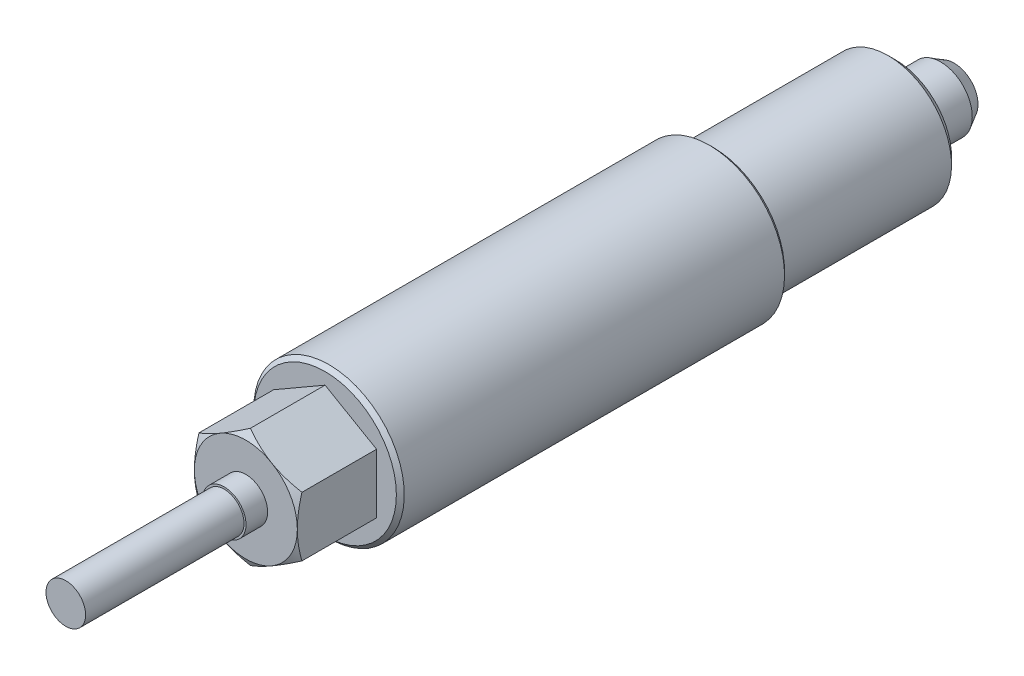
ISO-10303-21;
HEADER;
FILE_DESCRIPTION(('STEP AP214'),'2;1');
FILE_NAME('part.step','',(''),(''),'','','');
FILE_SCHEMA(('AUTOMOTIVE_DESIGN { 1 0 10303 214 1 1 1 1 }'));
ENDSEC;
DATA;
#1=APPLICATION_CONTEXT('core data for automotive mechanical design processes');
#2=APPLICATION_PROTOCOL_DEFINITION('international standard','automotive_design',2000,#1);
#3=PRODUCT_CONTEXT('',#1,'mechanical');
#4=PRODUCT('Part','Part','',(#3));
#5=PRODUCT_RELATED_PRODUCT_CATEGORY('part','',(#4));
#6=PRODUCT_DEFINITION_FORMATION('','',#4);
#7=PRODUCT_DEFINITION_CONTEXT('part definition',#1,'design');
#8=PRODUCT_DEFINITION('design','',#6,#7);
#9=PRODUCT_DEFINITION_SHAPE('','',#8);
#10=(LENGTH_UNIT() NAMED_UNIT(*) SI_UNIT(.MILLI.,.METRE.));
#11=(NAMED_UNIT(*) PLANE_ANGLE_UNIT() SI_UNIT($,.RADIAN.));
#12=(NAMED_UNIT(*) SI_UNIT($,.STERADIAN.) SOLID_ANGLE_UNIT());
#13=UNCERTAINTY_MEASURE_WITH_UNIT(LENGTH_MEASURE(1.E-05),#10,'distance_accuracy_value','');
#14=(GEOMETRIC_REPRESENTATION_CONTEXT(3) GLOBAL_UNCERTAINTY_ASSIGNED_CONTEXT((#13)) GLOBAL_UNIT_ASSIGNED_CONTEXT((#10,
#11,#12)) REPRESENTATION_CONTEXT('',''));
#15=CARTESIAN_POINT('',(0.,0.,0.));
#16=DIRECTION('',(0.,0.,1.));
#17=DIRECTION('',(1.,0.,0.));
#18=AXIS2_PLACEMENT_3D('',#15,#16,#17);
#19=CARTESIAN_POINT('',(0.,0.,72.));
#20=DIRECTION('',(0.,0.,-1.));
#21=DIRECTION('',(0.,1.,0.));
#22=AXIS2_PLACEMENT_3D('',#19,#20,#21);
#23=CONICAL_SURFACE('',#22,9.,0.785398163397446);
#24=CARTESIAN_POINT('',(0.,0.,71.5));
#25=DIRECTION('',(0.,0.,-1.));
#26=DIRECTION('',(0.,1.,0.));
#27=AXIS2_PLACEMENT_3D('',#24,#25,#26);
#28=CIRCLE('',#27,9.5);
#29=CARTESIAN_POINT('',(0.,9.5,71.5));
#30=VERTEX_POINT('',#29);
#31=EDGE_CURVE('E151',#30,#30,#28,.T.);
#32=ORIENTED_EDGE('',*,*,#31,.F.);
#33=EDGE_LOOP('',(#32));
#34=FACE_BOUND('',#33,.T.);
#35=CARTESIAN_POINT('',(0.,0.,72.));
#36=DIRECTION('',(0.,0.,1.));
#37=DIRECTION('',(0.,-1.,0.));
#38=AXIS2_PLACEMENT_3D('',#35,#36,#37);
#39=CIRCLE('',#38,9.);
#40=CARTESIAN_POINT('',(0.,-9.,72.));
#41=VERTEX_POINT('',#40);
#42=EDGE_CURVE('E120',#41,#41,#39,.T.);
#43=ORIENTED_EDGE('',*,*,#42,.F.);
#44=EDGE_LOOP('',(#43));
#45=FACE_BOUND('',#44,.T.);
#46=ADVANCED_FACE('F14',(#34,#45),#23,.T.);
#47=CARTESIAN_POINT('',(0.,0.,0.));
#48=DIRECTION('',(0.,0.,-1.));
#49=DIRECTION('',(0.,1.,0.));
#50=AXIS2_PLACEMENT_3D('',#47,#48,#49);
#51=CYLINDRICAL_SURFACE('',#50,9.5);
#52=CARTESIAN_POINT('',(0.,0.,23.5));
#53=DIRECTION('',(0.,0.,-1.));
#54=DIRECTION('',(0.,1.,0.));
#55=AXIS2_PLACEMENT_3D('',#52,#53,#54);
#56=CIRCLE('',#55,9.5);
#57=CARTESIAN_POINT('',(0.,9.5,23.5));
#58=VERTEX_POINT('',#57);
#59=EDGE_CURVE('E148',#58,#58,#56,.T.);
#60=ORIENTED_EDGE('',*,*,#59,.F.);
#61=EDGE_LOOP('',(#60));
#62=FACE_BOUND('',#61,.T.);
#63=ORIENTED_EDGE('',*,*,#31,.T.);
#64=EDGE_LOOP('',(#63));
#65=FACE_BOUND('',#64,.T.);
#66=ADVANCED_FACE('F218',(#62,#65),#51,.T.);
#67=CARTESIAN_POINT('',(0.,0.,23.5));
#68=DIRECTION('',(0.,0.,1.));
#69=DIRECTION('',(0.,-1.,0.));
#70=AXIS2_PLACEMENT_3D('',#67,#68,#69);
#71=CONICAL_SURFACE('',#70,9.5,0.785398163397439);
#72=CARTESIAN_POINT('',(0.,0.,23.));
#73=DIRECTION('',(0.,0.,-1.));
#74=DIRECTION('',(0.,1.,0.));
#75=AXIS2_PLACEMENT_3D('',#72,#73,#74);
#76=CIRCLE('',#75,9.);
#77=CARTESIAN_POINT('',(0.,9.,23.));
#78=VERTEX_POINT('',#77);
#79=EDGE_CURVE('E145',#78,#78,#76,.T.);
#80=ORIENTED_EDGE('',*,*,#79,.F.);
#81=EDGE_LOOP('',(#80));
#82=FACE_BOUND('',#81,.T.);
#83=ORIENTED_EDGE('',*,*,#59,.T.);
#84=EDGE_LOOP('',(#83));
#85=FACE_BOUND('',#84,.T.);
#86=ADVANCED_FACE('F214',(#82,#85),#71,.T.);
#87=CARTESIAN_POINT('',(9.,0.,23.));
#88=DIRECTION('',(0.,0.,1.));
#89=DIRECTION('',(0.,-1.,0.));
#90=AXIS2_PLACEMENT_3D('',#87,#88,#89);
#91=PLANE('',#90);
#92=CARTESIAN_POINT('',(0.,0.,23.));
#93=DIRECTION('',(0.,0.,-1.));
#94=DIRECTION('',(0.,1.,0.));
#95=AXIS2_PLACEMENT_3D('',#92,#93,#94);
#96=CIRCLE('',#95,8.);
#97=CARTESIAN_POINT('',(0.,8.,23.));
#98=VERTEX_POINT('',#97);
#99=EDGE_CURVE('E142',#98,#98,#96,.T.);
#100=ORIENTED_EDGE('',*,*,#99,.F.);
#101=EDGE_LOOP('',(#100));
#102=FACE_BOUND('',#101,.T.);
#103=ORIENTED_EDGE('',*,*,#79,.T.);
#104=EDGE_LOOP('',(#103));
#105=FACE_BOUND('',#104,.T.);
#106=ADVANCED_FACE('F211',(#102,#105),#91,.F.);
#107=CARTESIAN_POINT('',(-6.5,3.75277674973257,72.));
#108=DIRECTION('',(-1.,0.,0.));
#109=DIRECTION('',(0.,-1.,0.));
#110=AXIS2_PLACEMENT_3D('',#107,#108,#109);
#111=PLANE('',#110);
#112=CARTESIAN_POINT('',(-6.5,10.2763596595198,78.7324831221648));
#113=CARTESIAN_POINT('',(-6.5,9.99076655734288,78.8717978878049));
#114=CARTESIAN_POINT('',(-6.5,9.70453853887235,79.0098323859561));
#115=CARTESIAN_POINT('',(-6.5,9.13047575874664,79.2826245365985));
#116=CARTESIAN_POINT('',(-6.5,8.84264076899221,79.4173817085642));
#117=CARTESIAN_POINT('',(-6.5,8.26363576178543,79.6835396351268));
#118=CARTESIAN_POINT('',(-6.5,7.97245621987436,79.8149197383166));
#119=CARTESIAN_POINT('',(-6.5,7.38784879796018,80.0725591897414));
#120=CARTESIAN_POINT('',(-6.5,7.09442101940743,80.198818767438));
#121=CARTESIAN_POINT('',(-6.5,6.49464300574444,80.4491320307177));
#122=CARTESIAN_POINT('',(-6.5,6.18819718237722,80.5729578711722));
#123=CARTESIAN_POINT('',(-6.5,5.57179299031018,80.8117035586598));
#124=CARTESIAN_POINT('',(-6.5,5.26183424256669,80.9266224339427));
#125=CARTESIAN_POINT('',(-6.5,4.63843190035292,81.1446801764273));
#126=CARTESIAN_POINT('',(-6.5,4.32499616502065,81.2478412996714));
#127=CARTESIAN_POINT('',(-6.5,3.69362884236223,81.4392023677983));
#128=CARTESIAN_POINT('',(-6.5,3.37569864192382,81.5274068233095));
#129=CARTESIAN_POINT('',(-6.5,2.73698980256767,81.68427431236));
#130=CARTESIAN_POINT('',(-6.5,2.41623944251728,81.753050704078));
#131=CARTESIAN_POINT('',(-6.5,1.77050619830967,81.8673090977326));
#132=CARTESIAN_POINT('',(-6.5,1.44552377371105,81.9127936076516));
#133=CARTESIAN_POINT('',(-6.5,0.958338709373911,81.9605417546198));
#134=CARTESIAN_POINT('',(-6.5,0.797100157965,81.9730273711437));
#135=CARTESIAN_POINT('',(-6.5,0.474232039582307,81.9911671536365));
#136=CARTESIAN_POINT('',(-6.5,0.312602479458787,81.9968214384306));
#137=CARTESIAN_POINT('',(-6.5,-0.010749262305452,82.0011555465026));
#138=CARTESIAN_POINT('',(-6.5,-0.172471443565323,81.9998353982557));
#139=CARTESIAN_POINT('',(-6.5,-0.495712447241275,81.990256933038));
#140=CARTESIAN_POINT('',(-6.5,-0.657231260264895,81.9819983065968));
#141=CARTESIAN_POINT('',(-6.5,-1.03963616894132,81.9544103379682));
#142=CARTESIAN_POINT('',(-6.5,-1.2603129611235,81.9321102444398));
#143=CARTESIAN_POINT('',(-6.5,-1.70014458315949,81.8757312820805));
#144=CARTESIAN_POINT('',(-6.5,-1.91929922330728,81.8416509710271));
#145=CARTESIAN_POINT('',(-6.5,-2.57416487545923,81.7235370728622));
#146=CARTESIAN_POINT('',(-6.5,-3.00706059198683,81.6236483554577));
#147=CARTESIAN_POINT('',(-6.5,-3.65462319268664,81.4489548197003));
#148=CARTESIAN_POINT('',(-6.5,-3.87260785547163,81.3857275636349));
#149=CARTESIAN_POINT('',(-6.5,-4.30646460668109,81.2523342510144));
#150=CARTESIAN_POINT('',(-6.5,-4.52233667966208,81.1821681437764));
#151=CARTESIAN_POINT('',(-6.5,-4.9520291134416,81.0360533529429));
#152=CARTESIAN_POINT('',(-6.5,-5.16585003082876,80.9601062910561));
#153=CARTESIAN_POINT('',(-6.5,-5.59169572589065,80.803359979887));
#154=CARTESIAN_POINT('',(-6.5,-5.80372053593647,80.722560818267));
#155=CARTESIAN_POINT('',(-6.5,-6.34343564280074,80.5109285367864));
#156=CARTESIAN_POINT('',(-6.5,-6.66999681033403,80.3772195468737));
#157=CARTESIAN_POINT('',(-6.5,-7.31996529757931,80.1023186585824));
#158=CARTESIAN_POINT('',(-6.5,-7.64337232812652,79.961126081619));
#159=CARTESIAN_POINT('',(-6.5,-8.28769423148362,79.672908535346));
#160=CARTESIAN_POINT('',(-6.5,-8.60860826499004,79.5258816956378));
#161=CARTESIAN_POINT('',(-6.5,-9.2483019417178,79.2272963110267));
#162=CARTESIAN_POINT('',(-6.5,-9.56708165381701,79.0757379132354));
#163=CARTESIAN_POINT('',(-6.5,-10.2033542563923,78.7687988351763));
#164=CARTESIAN_POINT('',(-6.5,-10.5208446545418,78.6134129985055));
#165=CARTESIAN_POINT('',(-6.5,-11.1543829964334,78.2997281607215));
#166=CARTESIAN_POINT('',(-6.5,-11.4704309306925,78.1414291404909));
#167=CARTESIAN_POINT('',(-6.5,-12.4166711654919,77.6630636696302));
#168=CARTESIAN_POINT('',(-6.5,-13.0450798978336,77.3394703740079));
#169=CARTESIAN_POINT('',(-6.5,-14.2379592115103,76.7174590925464));
#170=CARTESIAN_POINT('',(-6.5,-14.8027388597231,76.4196309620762));
#171=CARTESIAN_POINT('',(-6.5,-15.9302653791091,75.8200844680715));
#172=CARTESIAN_POINT('',(-6.5,-16.4930121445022,75.518365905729));
#173=CARTESIAN_POINT('',(-6.5,-17.6151861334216,74.9129601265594));
#174=CARTESIAN_POINT('',(-6.5,-18.1746182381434,74.609281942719));
#175=CARTESIAN_POINT('',(-6.5,-19.292203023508,73.9996728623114));
#176=CARTESIAN_POINT('',(-6.5,-19.8503557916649,73.6937421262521));
#177=CARTESIAN_POINT('',(-6.5,-20.4080502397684,73.3869836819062));
#178=B_SPLINE_CURVE_WITH_KNOTS('',3,(#112,#113,#114,#115,#116,#117,#118,#119,#120,#121,#122,
#123,#124,#125,#126,#127,#128,#129,#130,#131,#132,#133,#134,#135,#136,#137,#138,#139,#140,#141,
#142,#143,#144,#145,#146,#147,#148,#149,#150,#151,#152,#153,#154,#155,#156,#157,#158,#159,#160,
#161,#162,#163,#164,#165,#166,#167,#168,#169,#170,#171,#172,#173,#174,#175,#176,#177),
.UNSPECIFIED.,.F.,.F.,(4,2,2,2,2,2,2,2,2,2,2,2,2,2,2,2,2,2,2,2,2,2,2,2,2,2,2,2,2,2,2,2,4),(0.,
0.953293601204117,1.90672614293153,2.86502696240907,3.82328479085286,4.81473058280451,
5.80628438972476,6.79592898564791,7.785274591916,8.76872238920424,9.75206427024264,
10.237105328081,10.7221379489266,11.207168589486,11.6922208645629,12.3572512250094,
13.0223630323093,14.3532369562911,15.0340821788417,15.7149323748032,16.3955922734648,
17.0762398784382,18.1347295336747,19.1933153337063,20.2522432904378,21.3111369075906,
22.371544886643,23.4319598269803,25.5523893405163,27.4678627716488,29.3834344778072,
31.2930526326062,33.2025360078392),.UNSPECIFIED.);
#179=CARTESIAN_POINT('',(-6.5,-3.75277674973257,81.4194434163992));
#180=VERTEX_POINT('',#179);
#181=CARTESIAN_POINT('',(-6.5,0.,82.));
#182=VERTEX_POINT('',#181);
#183=EDGE_CURVE('E9',#180,#182,#178,.F.);
#184=ORIENTED_EDGE('',*,*,#183,.T.);
#185=CARTESIAN_POINT('',(-6.5,3.75277674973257,81.4194434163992));
#186=VERTEX_POINT('',#185);
#187=EDGE_CURVE('E18',#182,#186,#178,.F.);
#188=ORIENTED_EDGE('',*,*,#187,.T.);
#189=DIRECTION('',(0.,0.,1.));
#190=VECTOR('',#189,1.);
#191=CARTESIAN_POINT('',(-6.5,3.75277674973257,72.));
#192=LINE('',#191,#190);
#193=CARTESIAN_POINT('',(-6.5,3.75277674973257,72.));
#194=VERTEX_POINT('',#193);
#195=EDGE_CURVE('E111',#194,#186,#192,.T.);
#196=ORIENTED_EDGE('',*,*,#195,.F.);
#197=DIRECTION('',(0.,-1.,0.));
#198=VECTOR('',#197,1.);
#199=CARTESIAN_POINT('',(-6.5,3.75277674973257,72.));
#200=LINE('',#199,#198);
#201=CARTESIAN_POINT('',(-6.5,-3.75277674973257,72.));
#202=VERTEX_POINT('',#201);
#203=EDGE_CURVE('E97',#194,#202,#200,.T.);
#204=ORIENTED_EDGE('',*,*,#203,.T.);
#205=DIRECTION('',(0.,0.,1.));
#206=VECTOR('',#205,1.);
#207=CARTESIAN_POINT('',(-6.5,-3.75277674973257,72.));
#208=LINE('',#207,#206);
#209=EDGE_CURVE('E89',#202,#180,#208,.T.);
#210=ORIENTED_EDGE('',*,*,#209,.T.);
#211=EDGE_LOOP('',(#184,#188,#196,#204,#210));
#212=FACE_BOUND('',#211,.T.);
#213=ADVANCED_FACE('F110',(#212),#111,.T.);
#214=CARTESIAN_POINT('',(0.,7.50555349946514,72.));
#215=DIRECTION('',(-0.5,0.866025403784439,0.));
#216=DIRECTION('',(-0.866025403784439,-0.5,0.));
#217=AXIS2_PLACEMENT_3D('',#214,#215,#216);
#218=PLANE('',#217);
#219=CARTESIAN_POINT('',(-6.5002,3.75266127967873,81.4193767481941));
#220=CARTESIAN_POINT('',(-6.35732254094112,3.83515161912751,81.4669955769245));
#221=CARTESIAN_POINT('',(-6.21391236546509,3.91794952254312,81.5124532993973));
#222=CARTESIAN_POINT('',(-5.92592736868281,4.08421773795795,81.598451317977));
#223=CARTESIAN_POINT('',(-5.78135207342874,4.16768832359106,81.638989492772));
#224=CARTESIAN_POINT('',(-5.34531134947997,4.41943655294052,81.7524289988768));
#225=CARTESIAN_POINT('',(-5.05212471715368,4.5887079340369,81.8169521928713));
#226=CARTESIAN_POINT('',(-4.61337625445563,4.84201947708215,81.8926134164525));
#227=CARTESIAN_POINT('',(-4.46912536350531,4.92530276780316,81.914167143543));
#228=CARTESIAN_POINT('',(-4.17997178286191,5.09224566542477,81.9503096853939));
#229=CARTESIAN_POINT('',(-4.03506915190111,5.17590523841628,81.9648991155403));
#230=CARTESIAN_POINT('',(-3.74501222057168,5.34336968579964,81.9867412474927));
#231=CARTESIAN_POINT('',(-3.59985839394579,5.427174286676,81.9940022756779));
#232=CARTESIAN_POINT('',(-3.30942466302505,5.59485627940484,82.0010396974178));
#233=CARTESIAN_POINT('',(-3.16414476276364,5.6787336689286,82.0008163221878));
#234=CARTESIAN_POINT('',(-2.7661240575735,5.90853103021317,81.9899165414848));
#235=CARTESIAN_POINT('',(-2.51351353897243,6.05437578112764,81.9716181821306));
#236=CARTESIAN_POINT('',(-2.00997032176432,6.34509659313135,81.9135936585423));
#237=CARTESIAN_POINT('',(-1.75903939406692,6.48997163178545,81.8738476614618));
#238=CARTESIAN_POINT('',(-1.25448277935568,6.78127752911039,81.7744940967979));
#239=CARTESIAN_POINT('',(-1.00092075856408,6.92767163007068,81.714465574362));
#240=CARTESIAN_POINT('',(-0.497578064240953,7.21827667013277,81.5782250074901));
#241=CARTESIAN_POINT('',(-0.247790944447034,7.36249133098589,81.5020449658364));
#242=CARTESIAN_POINT('',(0.000200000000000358,7.50566896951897,81.4193767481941));
#243=B_SPLINE_CURVE_WITH_KNOTS('',3,(#219,#220,#221,#222,#223,#224,#225,#226,#227,#228,#229,
#230,#231,#232,#233,#234,#235,#236,#237,#238,#239,#240,#241,#242),.UNSPECIFIED.,.F.,.F.,(4,2,2,
2,2,2,2,2,2,2,2,4),(0.,0.515105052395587,1.03043143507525,2.06322554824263,2.56697389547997,
3.07067772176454,3.57380860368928,4.07692394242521,4.95279354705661,5.82947446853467,
6.72559912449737,7.61996451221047),.UNSPECIFIED.);
#244=CARTESIAN_POINT('',(-3.25,5.62916512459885,82.));
#245=VERTEX_POINT('',#244);
#246=EDGE_CURVE('E257',#186,#245,#243,.T.);
#247=ORIENTED_EDGE('',*,*,#246,.T.);
#248=CARTESIAN_POINT('',(0.,7.50555349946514,81.4194434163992));
#249=VERTEX_POINT('',#248);
#250=EDGE_CURVE('E251',#245,#249,#243,.T.);
#251=ORIENTED_EDGE('',*,*,#250,.T.);
#252=DIRECTION('',(0.,0.,1.));
#253=VECTOR('',#252,1.);
#254=CARTESIAN_POINT('',(0.,7.50555349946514,72.));
#255=LINE('',#254,#253);
#256=CARTESIAN_POINT('',(0.,7.50555349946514,72.));
#257=VERTEX_POINT('',#256);
#258=EDGE_CURVE('E121',#257,#249,#255,.T.);
#259=ORIENTED_EDGE('',*,*,#258,.F.);
#260=DIRECTION('',(-0.866025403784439,-0.5,0.));
#261=VECTOR('',#260,1.);
#262=CARTESIAN_POINT('',(0.,7.50555349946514,72.));
#263=LINE('',#262,#261);
#264=EDGE_CURVE('E113',#257,#194,#263,.T.);
#265=ORIENTED_EDGE('',*,*,#264,.T.);
#266=ORIENTED_EDGE('',*,*,#195,.T.);
#267=EDGE_LOOP('',(#247,#251,#259,#265,#266));
#268=FACE_BOUND('',#267,.T.);
#269=ADVANCED_FACE('F244',(#268),#218,.T.);
#270=CARTESIAN_POINT('',(6.5,3.75277674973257,72.));
#271=DIRECTION('',(0.5,0.866025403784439,0.));
#272=DIRECTION('',(-0.866025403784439,0.5,0.));
#273=AXIS2_PLACEMENT_3D('',#270,#271,#272);
#274=PLANE('',#273);
#275=CARTESIAN_POINT('',(-0.00020000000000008,7.50566896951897,81.4193767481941));
#276=CARTESIAN_POINT('',(0.142677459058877,7.4231786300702,81.4669955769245));
#277=CARTESIAN_POINT('',(0.286087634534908,7.34038072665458,81.5124532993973));
#278=CARTESIAN_POINT('',(0.574072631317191,7.17411251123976,81.598451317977));
#279=CARTESIAN_POINT('',(0.718647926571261,7.09064192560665,81.638989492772));
#280=CARTESIAN_POINT('',(1.15468865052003,6.83889369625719,81.7524289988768));
#281=CARTESIAN_POINT('',(1.44787528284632,6.66962231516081,81.8169521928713));
#282=CARTESIAN_POINT('',(1.88662374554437,6.41631077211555,81.8926134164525));
#283=CARTESIAN_POINT('',(2.03087463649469,6.33302748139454,81.914167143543));
#284=CARTESIAN_POINT('',(2.32002821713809,6.16608458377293,81.9503096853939));
#285=CARTESIAN_POINT('',(2.46493084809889,6.08242501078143,81.9648991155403));
#286=CARTESIAN_POINT('',(2.75498777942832,5.91496056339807,81.9867412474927));
#287=CARTESIAN_POINT('',(2.90014160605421,5.8311559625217,81.9940022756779));
#288=CARTESIAN_POINT('',(3.19057533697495,5.66347396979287,82.0010396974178));
#289=CARTESIAN_POINT('',(3.33585523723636,5.5795965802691,82.0008163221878));
#290=CARTESIAN_POINT('',(3.7338759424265,5.34979921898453,81.9899165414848));
#291=CARTESIAN_POINT('',(3.98648646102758,5.20395446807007,81.9716181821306));
#292=CARTESIAN_POINT('',(4.49002967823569,4.91323365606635,81.9135936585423));
#293=CARTESIAN_POINT('',(4.74096060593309,4.76835861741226,81.8738476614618));
#294=CARTESIAN_POINT('',(5.24551722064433,4.47705272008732,81.7744940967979));
#295=CARTESIAN_POINT('',(5.49907924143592,4.33065861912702,81.714465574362));
#296=CARTESIAN_POINT('',(6.00242193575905,4.04005357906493,81.5782250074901));
#297=CARTESIAN_POINT('',(6.25220905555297,3.89583891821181,81.5020449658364));
#298=CARTESIAN_POINT('',(6.5002,3.75266127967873,81.4193767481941));
#299=B_SPLINE_CURVE_WITH_KNOTS('',3,(#275,#276,#277,#278,#279,#280,#281,#282,#283,#284,#285,
#286,#287,#288,#289,#290,#291,#292,#293,#294,#295,#296,#297,#298),.UNSPECIFIED.,.F.,.F.,(4,2,2,
2,2,2,2,2,2,2,2,4),(0.,0.515105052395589,1.03043143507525,2.06322554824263,2.56697389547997,
3.07067772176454,3.57380860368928,4.07692394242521,4.95279354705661,5.82947446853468,
6.72559912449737,7.61996451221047),.UNSPECIFIED.);
#300=CARTESIAN_POINT('',(3.25,5.62916512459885,82.));
#301=VERTEX_POINT('',#300);
#302=EDGE_CURVE('E258',#249,#301,#299,.T.);
#303=ORIENTED_EDGE('',*,*,#302,.T.);
#304=CARTESIAN_POINT('',(6.5,3.75277674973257,81.4194434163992));
#305=VERTEX_POINT('',#304);
#306=EDGE_CURVE('E259',#301,#305,#299,.T.);
#307=ORIENTED_EDGE('',*,*,#306,.T.);
#308=DIRECTION('',(0.,0.,1.));
#309=VECTOR('',#308,1.);
#310=CARTESIAN_POINT('',(6.5,3.75277674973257,72.));
#311=LINE('',#310,#309);
#312=CARTESIAN_POINT('',(6.5,3.75277674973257,72.));
#313=VERTEX_POINT('',#312);
#314=EDGE_CURVE('E124',#313,#305,#311,.T.);
#315=ORIENTED_EDGE('',*,*,#314,.F.);
#316=DIRECTION('',(-0.866025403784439,0.5,0.));
#317=VECTOR('',#316,1.);
#318=CARTESIAN_POINT('',(6.5,3.75277674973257,72.));
#319=LINE('',#318,#317);
#320=EDGE_CURVE('E115',#313,#257,#319,.T.);
#321=ORIENTED_EDGE('',*,*,#320,.T.);
#322=ORIENTED_EDGE('',*,*,#258,.T.);
#323=EDGE_LOOP('',(#303,#307,#315,#321,#322));
#324=FACE_BOUND('',#323,.T.);
#325=ADVANCED_FACE('F248',(#324),#274,.T.);
#326=CARTESIAN_POINT('',(6.5,-3.75277674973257,72.));
#327=DIRECTION('',(1.,0.,0.));
#328=DIRECTION('',(0.,1.,0.));
#329=AXIS2_PLACEMENT_3D('',#326,#327,#328);
#330=PLANE('',#329);
#331=CARTESIAN_POINT('',(6.5,10.2763596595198,78.7324831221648));
#332=CARTESIAN_POINT('',(6.5,9.99076655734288,78.8717978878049));
#333=CARTESIAN_POINT('',(6.5,9.70453853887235,79.0098323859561));
#334=CARTESIAN_POINT('',(6.5,9.13047575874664,79.2826245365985));
#335=CARTESIAN_POINT('',(6.5,8.84264076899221,79.4173817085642));
#336=CARTESIAN_POINT('',(6.5,8.26363576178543,79.6835396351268));
#337=CARTESIAN_POINT('',(6.5,7.97245621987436,79.8149197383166));
#338=CARTESIAN_POINT('',(6.5,7.38784879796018,80.0725591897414));
#339=CARTESIAN_POINT('',(6.5,7.09442101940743,80.198818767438));
#340=CARTESIAN_POINT('',(6.5,6.49464300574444,80.4491320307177));
#341=CARTESIAN_POINT('',(6.5,6.18819718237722,80.5729578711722));
#342=CARTESIAN_POINT('',(6.5,5.57179299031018,80.8117035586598));
#343=CARTESIAN_POINT('',(6.5,5.26183424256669,80.9266224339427));
#344=CARTESIAN_POINT('',(6.5,4.63843190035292,81.1446801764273));
#345=CARTESIAN_POINT('',(6.5,4.32499616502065,81.2478412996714));
#346=CARTESIAN_POINT('',(6.5,3.69362884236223,81.4392023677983));
#347=CARTESIAN_POINT('',(6.5,3.37569864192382,81.5274068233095));
#348=CARTESIAN_POINT('',(6.5,2.73698980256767,81.68427431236));
#349=CARTESIAN_POINT('',(6.5,2.41623944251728,81.753050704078));
#350=CARTESIAN_POINT('',(6.5,1.77050619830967,81.8673090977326));
#351=CARTESIAN_POINT('',(6.5,1.44552377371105,81.9127936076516));
#352=CARTESIAN_POINT('',(6.5,0.958338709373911,81.9605417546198));
#353=CARTESIAN_POINT('',(6.5,0.797100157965,81.9730273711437));
#354=CARTESIAN_POINT('',(6.5,0.474232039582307,81.9911671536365));
#355=CARTESIAN_POINT('',(6.5,0.312602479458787,81.9968214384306));
#356=CARTESIAN_POINT('',(6.5,-0.010749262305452,82.0011555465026));
#357=CARTESIAN_POINT('',(6.5,-0.172471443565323,81.9998353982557));
#358=CARTESIAN_POINT('',(6.5,-0.495712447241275,81.990256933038));
#359=CARTESIAN_POINT('',(6.5,-0.657231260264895,81.9819983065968));
#360=CARTESIAN_POINT('',(6.5,-1.03963616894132,81.9544103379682));
#361=CARTESIAN_POINT('',(6.5,-1.2603129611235,81.9321102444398));
#362=CARTESIAN_POINT('',(6.5,-1.70014458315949,81.8757312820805));
#363=CARTESIAN_POINT('',(6.5,-1.91929922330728,81.8416509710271));
#364=CARTESIAN_POINT('',(6.5,-2.57416487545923,81.7235370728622));
#365=CARTESIAN_POINT('',(6.5,-3.00706059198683,81.6236483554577));
#366=CARTESIAN_POINT('',(6.5,-3.65462319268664,81.4489548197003));
#367=CARTESIAN_POINT('',(6.5,-3.87260785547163,81.3857275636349));
#368=CARTESIAN_POINT('',(6.5,-4.30646460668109,81.2523342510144));
#369=CARTESIAN_POINT('',(6.5,-4.52233667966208,81.1821681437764));
#370=CARTESIAN_POINT('',(6.5,-4.9520291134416,81.0360533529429));
#371=CARTESIAN_POINT('',(6.5,-5.16585003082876,80.9601062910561));
#372=CARTESIAN_POINT('',(6.5,-5.59169572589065,80.803359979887));
#373=CARTESIAN_POINT('',(6.5,-5.80372053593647,80.722560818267));
#374=CARTESIAN_POINT('',(6.5,-6.34343564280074,80.5109285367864));
#375=CARTESIAN_POINT('',(6.5,-6.66999681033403,80.3772195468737));
#376=CARTESIAN_POINT('',(6.5,-7.31996529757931,80.1023186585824));
#377=CARTESIAN_POINT('',(6.5,-7.64337232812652,79.961126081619));
#378=CARTESIAN_POINT('',(6.5,-8.28769423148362,79.672908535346));
#379=CARTESIAN_POINT('',(6.5,-8.60860826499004,79.5258816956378));
#380=CARTESIAN_POINT('',(6.5,-9.2483019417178,79.2272963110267));
#381=CARTESIAN_POINT('',(6.5,-9.56708165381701,79.0757379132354));
#382=CARTESIAN_POINT('',(6.5,-10.2033542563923,78.7687988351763));
#383=CARTESIAN_POINT('',(6.5,-10.5208446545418,78.6134129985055));
#384=CARTESIAN_POINT('',(6.5,-11.1543829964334,78.2997281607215));
#385=CARTESIAN_POINT('',(6.5,-11.4704309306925,78.1414291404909));
#386=CARTESIAN_POINT('',(6.5,-12.4166711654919,77.6630636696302));
#387=CARTESIAN_POINT('',(6.5,-13.0450798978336,77.3394703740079));
#388=CARTESIAN_POINT('',(6.5,-14.2379592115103,76.7174590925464));
#389=CARTESIAN_POINT('',(6.5,-14.8027388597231,76.4196309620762));
#390=CARTESIAN_POINT('',(6.5,-15.9302653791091,75.8200844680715));
#391=CARTESIAN_POINT('',(6.5,-16.4930121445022,75.518365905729));
#392=CARTESIAN_POINT('',(6.5,-17.6151861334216,74.9129601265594));
#393=CARTESIAN_POINT('',(6.5,-18.1746182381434,74.609281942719));
#394=CARTESIAN_POINT('',(6.5,-19.292203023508,73.9996728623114));
#395=CARTESIAN_POINT('',(6.5,-19.8503557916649,73.6937421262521));
#396=CARTESIAN_POINT('',(6.5,-20.4080502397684,73.3869836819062));
#397=B_SPLINE_CURVE_WITH_KNOTS('',3,(#331,#332,#333,#334,#335,#336,#337,#338,#339,#340,#341,
#342,#343,#344,#345,#346,#347,#348,#349,#350,#351,#352,#353,#354,#355,#356,#357,#358,#359,#360,
#361,#362,#363,#364,#365,#366,#367,#368,#369,#370,#371,#372,#373,#374,#375,#376,#377,#378,#379,
#380,#381,#382,#383,#384,#385,#386,#387,#388,#389,#390,#391,#392,#393,#394,#395,#396),
.UNSPECIFIED.,.F.,.F.,(4,2,2,2,2,2,2,2,2,2,2,2,2,2,2,2,2,2,2,2,2,2,2,2,2,2,2,2,2,2,2,2,4),(0.,
0.953293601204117,1.90672614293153,2.86502696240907,3.82328479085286,4.81473058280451,
5.80628438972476,6.79592898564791,7.785274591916,8.76872238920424,9.75206427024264,
10.237105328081,10.7221379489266,11.207168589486,11.6922208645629,12.3572512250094,
13.0223630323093,14.3532369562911,15.0340821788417,15.7149323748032,16.3955922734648,
17.0762398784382,18.1347295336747,19.1933153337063,20.2522432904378,21.3111369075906,
22.371544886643,23.4319598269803,25.5523893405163,27.4678627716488,29.3834344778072,
31.2930526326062,33.2025360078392),.UNSPECIFIED.);
#398=CARTESIAN_POINT('',(6.5,0.,82.));
#399=VERTEX_POINT('',#398);
#400=EDGE_CURVE('E264',#305,#399,#397,.T.);
#401=ORIENTED_EDGE('',*,*,#400,.T.);
#402=CARTESIAN_POINT('',(6.5,-3.75277674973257,81.4194434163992));
#403=VERTEX_POINT('',#402);
#404=EDGE_CURVE('E265',#399,#403,#397,.T.);
#405=ORIENTED_EDGE('',*,*,#404,.T.);
#406=DIRECTION('',(0.,0.,1.));
#407=VECTOR('',#406,1.);
#408=CARTESIAN_POINT('',(6.5,-3.75277674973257,72.));
#409=LINE('',#408,#407);
#410=CARTESIAN_POINT('',(6.5,-3.75277674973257,72.));
#411=VERTEX_POINT('',#410);
#412=EDGE_CURVE('E127',#411,#403,#409,.T.);
#413=ORIENTED_EDGE('',*,*,#412,.F.);
#414=DIRECTION('',(0.,1.,0.));
#415=VECTOR('',#414,1.);
#416=CARTESIAN_POINT('',(6.5,-3.75277674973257,72.));
#417=LINE('',#416,#415);
#418=EDGE_CURVE('E319',#411,#313,#417,.T.);
#419=ORIENTED_EDGE('',*,*,#418,.T.);
#420=ORIENTED_EDGE('',*,*,#314,.T.);
#421=EDGE_LOOP('',(#401,#405,#413,#419,#420));
#422=FACE_BOUND('',#421,.T.);
#423=ADVANCED_FACE('F271',(#422),#330,.T.);
#424=CARTESIAN_POINT('',(0.,-7.50555349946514,72.));
#425=DIRECTION('',(0.5,-0.866025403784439,0.));
#426=DIRECTION('',(0.866025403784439,0.5,0.));
#427=AXIS2_PLACEMENT_3D('',#424,#425,#426);
#428=PLANE('',#427);
#429=CARTESIAN_POINT('',(6.5002,-3.75266127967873,81.4193767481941));
#430=CARTESIAN_POINT('',(6.35732254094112,-3.83515161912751,81.4669955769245));
#431=CARTESIAN_POINT('',(6.21391236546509,-3.91794952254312,81.5124532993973));
#432=CARTESIAN_POINT('',(5.92592736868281,-4.08421773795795,81.598451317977));
#433=CARTESIAN_POINT('',(5.78135207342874,-4.16768832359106,81.638989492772));
#434=CARTESIAN_POINT('',(5.34531134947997,-4.41943655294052,81.7524289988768));
#435=CARTESIAN_POINT('',(5.05212471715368,-4.5887079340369,81.8169521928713));
#436=CARTESIAN_POINT('',(4.61337625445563,-4.84201947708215,81.8926134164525));
#437=CARTESIAN_POINT('',(4.46912536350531,-4.92530276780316,81.914167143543));
#438=CARTESIAN_POINT('',(4.17997178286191,-5.09224566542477,81.9503096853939));
#439=CARTESIAN_POINT('',(4.03506915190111,-5.17590523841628,81.9648991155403));
#440=CARTESIAN_POINT('',(3.74501222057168,-5.34336968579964,81.9867412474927));
#441=CARTESIAN_POINT('',(3.59985839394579,-5.427174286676,81.9940022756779));
#442=CARTESIAN_POINT('',(3.30942466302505,-5.59485627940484,82.0010396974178));
#443=CARTESIAN_POINT('',(3.16414476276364,-5.6787336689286,82.0008163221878));
#444=CARTESIAN_POINT('',(2.7661240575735,-5.90853103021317,81.9899165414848));
#445=CARTESIAN_POINT('',(2.51351353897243,-6.05437578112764,81.9716181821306));
#446=CARTESIAN_POINT('',(2.00997032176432,-6.34509659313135,81.9135936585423));
#447=CARTESIAN_POINT('',(1.75903939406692,-6.48997163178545,81.8738476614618));
#448=CARTESIAN_POINT('',(1.25448277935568,-6.78127752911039,81.7744940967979));
#449=CARTESIAN_POINT('',(1.00092075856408,-6.92767163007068,81.714465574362));
#450=CARTESIAN_POINT('',(0.497578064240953,-7.21827667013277,81.5782250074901));
#451=CARTESIAN_POINT('',(0.247790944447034,-7.36249133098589,81.5020449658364));
#452=CARTESIAN_POINT('',(-0.000200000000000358,-7.50566896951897,81.4193767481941));
#453=B_SPLINE_CURVE_WITH_KNOTS('',3,(#429,#430,#431,#432,#433,#434,#435,#436,#437,#438,#439,
#440,#441,#442,#443,#444,#445,#446,#447,#448,#449,#450,#451,#452),.UNSPECIFIED.,.F.,.F.,(4,2,2,
2,2,2,2,2,2,2,2,4),(0.,0.515105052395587,1.03043143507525,2.06322554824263,2.56697389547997,
3.07067772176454,3.57380860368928,4.07692394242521,4.95279354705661,5.82947446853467,
6.72559912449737,7.61996451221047),.UNSPECIFIED.);
#454=CARTESIAN_POINT('',(3.25,-5.62916512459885,82.));
#455=VERTEX_POINT('',#454);
#456=EDGE_CURVE('E270',#403,#455,#453,.T.);
#457=ORIENTED_EDGE('',*,*,#456,.T.);
#458=CARTESIAN_POINT('',(0.,-7.50555349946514,81.4194434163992));
#459=VERTEX_POINT('',#458);
#460=EDGE_CURVE('E177',#455,#459,#453,.T.);
#461=ORIENTED_EDGE('',*,*,#460,.T.);
#462=DIRECTION('',(0.,0.,1.));
#463=VECTOR('',#462,1.);
#464=CARTESIAN_POINT('',(0.,-7.50555349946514,72.));
#465=LINE('',#464,#463);
#466=CARTESIAN_POINT('',(0.,-7.50555349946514,72.));
#467=VERTEX_POINT('',#466);
#468=EDGE_CURVE('E96',#467,#459,#465,.T.);
#469=ORIENTED_EDGE('',*,*,#468,.F.);
#470=DIRECTION('',(0.866025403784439,0.5,0.));
#471=VECTOR('',#470,1.);
#472=CARTESIAN_POINT('',(0.,-7.50555349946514,72.));
#473=LINE('',#472,#471);
#474=EDGE_CURVE('E107',#467,#411,#473,.T.);
#475=ORIENTED_EDGE('',*,*,#474,.T.);
#476=ORIENTED_EDGE('',*,*,#412,.T.);
#477=EDGE_LOOP('',(#457,#461,#469,#475,#476));
#478=FACE_BOUND('',#477,.T.);
#479=ADVANCED_FACE('F191',(#478),#428,.T.);
#480=CARTESIAN_POINT('',(-6.5,-3.75277674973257,72.));
#481=DIRECTION('',(-0.5,-0.866025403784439,0.));
#482=DIRECTION('',(0.866025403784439,-0.5,0.));
#483=AXIS2_PLACEMENT_3D('',#480,#481,#482);
#484=PLANE('',#483);
#485=CARTESIAN_POINT('',(0.00020000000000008,-7.50566896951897,81.4193767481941));
#486=CARTESIAN_POINT('',(-0.142677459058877,-7.4231786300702,81.4669955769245));
#487=CARTESIAN_POINT('',(-0.286087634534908,-7.34038072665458,81.5124532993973));
#488=CARTESIAN_POINT('',(-0.574072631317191,-7.17411251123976,81.598451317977));
#489=CARTESIAN_POINT('',(-0.718647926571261,-7.09064192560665,81.638989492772));
#490=CARTESIAN_POINT('',(-1.15468865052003,-6.83889369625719,81.7524289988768));
#491=CARTESIAN_POINT('',(-1.44787528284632,-6.66962231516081,81.8169521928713));
#492=CARTESIAN_POINT('',(-1.88662374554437,-6.41631077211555,81.8926134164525));
#493=CARTESIAN_POINT('',(-2.03087463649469,-6.33302748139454,81.914167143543));
#494=CARTESIAN_POINT('',(-2.32002821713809,-6.16608458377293,81.9503096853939));
#495=CARTESIAN_POINT('',(-2.46493084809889,-6.08242501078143,81.9648991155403));
#496=CARTESIAN_POINT('',(-2.75498777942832,-5.91496056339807,81.9867412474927));
#497=CARTESIAN_POINT('',(-2.90014160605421,-5.8311559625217,81.9940022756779));
#498=CARTESIAN_POINT('',(-3.19057533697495,-5.66347396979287,82.0010396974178));
#499=CARTESIAN_POINT('',(-3.33585523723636,-5.5795965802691,82.0008163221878));
#500=CARTESIAN_POINT('',(-3.7338759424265,-5.34979921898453,81.9899165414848));
#501=CARTESIAN_POINT('',(-3.98648646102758,-5.20395446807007,81.9716181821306));
#502=CARTESIAN_POINT('',(-4.49002967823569,-4.91323365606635,81.9135936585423));
#503=CARTESIAN_POINT('',(-4.74096060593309,-4.76835861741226,81.8738476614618));
#504=CARTESIAN_POINT('',(-5.24551722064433,-4.47705272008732,81.7744940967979));
#505=CARTESIAN_POINT('',(-5.49907924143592,-4.33065861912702,81.714465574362));
#506=CARTESIAN_POINT('',(-6.00242193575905,-4.04005357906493,81.5782250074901));
#507=CARTESIAN_POINT('',(-6.25220905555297,-3.89583891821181,81.5020449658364));
#508=CARTESIAN_POINT('',(-6.5002,-3.75266127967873,81.4193767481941));
#509=B_SPLINE_CURVE_WITH_KNOTS('',3,(#485,#486,#487,#488,#489,#490,#491,#492,#493,#494,#495,
#496,#497,#498,#499,#500,#501,#502,#503,#504,#505,#506,#507,#508),.UNSPECIFIED.,.F.,.F.,(4,2,2,
2,2,2,2,2,2,2,2,4),(0.,0.515105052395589,1.03043143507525,2.06322554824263,2.56697389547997,
3.07067772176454,3.57380860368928,4.07692394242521,4.95279354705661,5.82947446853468,
6.72559912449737,7.61996451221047),.UNSPECIFIED.);
#510=CARTESIAN_POINT('',(-3.25,-5.62916512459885,82.));
#511=VERTEX_POINT('',#510);
#512=EDGE_CURVE('E35',#459,#511,#509,.T.);
#513=ORIENTED_EDGE('',*,*,#512,.T.);
#514=EDGE_CURVE('E93',#511,#180,#509,.T.);
#515=ORIENTED_EDGE('',*,*,#514,.T.);
#516=ORIENTED_EDGE('',*,*,#209,.F.);
#517=DIRECTION('',(0.866025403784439,-0.5,0.));
#518=VECTOR('',#517,1.);
#519=CARTESIAN_POINT('',(-6.5,-3.75277674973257,72.));
#520=LINE('',#519,#518);
#521=EDGE_CURVE('E92',#202,#467,#520,.T.);
#522=ORIENTED_EDGE('',*,*,#521,.T.);
#523=ORIENTED_EDGE('',*,*,#468,.T.);
#524=EDGE_LOOP('',(#513,#515,#516,#522,#523));
#525=FACE_BOUND('',#524,.T.);
#526=ADVANCED_FACE('F91',(#525),#484,.T.);
#527=CARTESIAN_POINT('',(0.,0.,72.));
#528=DIRECTION('',(0.,0.,1.));
#529=DIRECTION('',(0.,-1.,0.));
#530=AXIS2_PLACEMENT_3D('',#527,#528,#529);
#531=PLANE('',#530);
#532=ORIENTED_EDGE('',*,*,#203,.F.);
#533=ORIENTED_EDGE('',*,*,#264,.F.);
#534=ORIENTED_EDGE('',*,*,#320,.F.);
#535=ORIENTED_EDGE('',*,*,#418,.F.);
#536=ORIENTED_EDGE('',*,*,#474,.F.);
#537=ORIENTED_EDGE('',*,*,#521,.F.);
#538=EDGE_LOOP('',(#532,#533,#534,#535,#536,#537));
#539=FACE_BOUND('',#538,.T.);
#540=ORIENTED_EDGE('',*,*,#42,.T.);
#541=EDGE_LOOP('',(#540));
#542=FACE_BOUND('',#541,.T.);
#543=ADVANCED_FACE('F102',(#539,#542),#531,.T.);
#544=CARTESIAN_POINT('',(0.,0.,104.73));
#545=DIRECTION('',(0.,0.,-1.));
#546=DIRECTION('',(0.,1.,0.));
#547=AXIS2_PLACEMENT_3D('',#544,#545,#546);
#548=PLANE('',#547);
#549=CARTESIAN_POINT('',(0.,0.,104.73));
#550=DIRECTION('',(0.,0.,-1.));
#551=DIRECTION('',(0.,1.,0.));
#552=AXIS2_PLACEMENT_3D('',#549,#550,#551);
#553=CIRCLE('',#552,2.5);
#554=CARTESIAN_POINT('',(0.,2.5,104.73));
#555=VERTEX_POINT('',#554);
#556=EDGE_CURVE('E168',#555,#555,#553,.T.);
#557=ORIENTED_EDGE('',*,*,#556,.F.);
#558=EDGE_LOOP('',(#557));
#559=FACE_BOUND('',#558,.T.);
#560=ADVANCED_FACE('F16',(#559),#548,.F.);
#561=CARTESIAN_POINT('',(0.,0.,0.));
#562=DIRECTION('',(0.,0.,-1.));
#563=DIRECTION('',(0.,1.,0.));
#564=AXIS2_PLACEMENT_3D('',#561,#562,#563);
#565=CYLINDRICAL_SURFACE('',#564,2.5);
#566=CARTESIAN_POINT('',(0.,0.,84.73));
#567=DIRECTION('',(0.,0.,-1.));
#568=DIRECTION('',(0.,1.,0.));
#569=AXIS2_PLACEMENT_3D('',#566,#567,#568);
#570=CIRCLE('',#569,2.5);
#571=CARTESIAN_POINT('',(0.,2.5,84.73));
#572=VERTEX_POINT('',#571);
#573=EDGE_CURVE('E165',#572,#572,#570,.T.);
#574=ORIENTED_EDGE('',*,*,#573,.F.);
#575=EDGE_LOOP('',(#574));
#576=FACE_BOUND('',#575,.T.);
#577=ORIENTED_EDGE('',*,*,#556,.T.);
#578=EDGE_LOOP('',(#577));
#579=FACE_BOUND('',#578,.T.);
#580=ADVANCED_FACE('F237',(#576,#579),#565,.T.);
#581=CARTESIAN_POINT('',(2.5,0.,84.73));
#582=DIRECTION('',(0.,0.,-1.));
#583=DIRECTION('',(0.,1.,0.));
#584=AXIS2_PLACEMENT_3D('',#581,#582,#583);
#585=PLANE('',#584);
#586=CARTESIAN_POINT('',(0.,0.,84.73));
#587=DIRECTION('',(0.,0.,-1.));
#588=DIRECTION('',(0.,1.,0.));
#589=AXIS2_PLACEMENT_3D('',#586,#587,#588);
#590=CIRCLE('',#589,2.75);
#591=CARTESIAN_POINT('',(0.,2.75,84.73));
#592=VERTEX_POINT('',#591);
#593=EDGE_CURVE('E162',#592,#592,#590,.T.);
#594=ORIENTED_EDGE('',*,*,#593,.F.);
#595=EDGE_LOOP('',(#594));
#596=FACE_BOUND('',#595,.T.);
#597=ORIENTED_EDGE('',*,*,#573,.T.);
#598=EDGE_LOOP('',(#597));
#599=FACE_BOUND('',#598,.T.);
#600=ADVANCED_FACE('F591',(#596,#599),#585,.F.);
#601=CARTESIAN_POINT('',(0.,0.,0.));
#602=DIRECTION('',(0.,0.,-1.));
#603=DIRECTION('',(0.,1.,0.));
#604=AXIS2_PLACEMENT_3D('',#601,#602,#603);
#605=CYLINDRICAL_SURFACE('',#604,2.75);
#606=CARTESIAN_POINT('',(0.,0.,82.));
#607=DIRECTION('',(0.,0.,-1.));
#608=DIRECTION('',(0.,1.,0.));
#609=AXIS2_PLACEMENT_3D('',#606,#607,#608);
#610=CIRCLE('',#609,2.75);
#611=CARTESIAN_POINT('',(0.,2.75,82.));
#612=VERTEX_POINT('',#611);
#613=EDGE_CURVE('E158',#612,#612,#610,.T.);
#614=ORIENTED_EDGE('',*,*,#613,.F.);
#615=EDGE_LOOP('',(#614));
#616=FACE_BOUND('',#615,.T.);
#617=ORIENTED_EDGE('',*,*,#593,.T.);
#618=EDGE_LOOP('',(#617));
#619=FACE_BOUND('',#618,.T.);
#620=ADVANCED_FACE('F584',(#616,#619),#605,.T.);
#621=CARTESIAN_POINT('',(0.,0.,82.));
#622=DIRECTION('',(0.,0.,-1.));
#623=DIRECTION('',(0.,1.,0.));
#624=AXIS2_PLACEMENT_3D('',#621,#622,#623);
#625=CONICAL_SURFACE('',#624,6.5,1.0471975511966);
#626=ORIENTED_EDGE('',*,*,#404,.F.);
#627=CARTESIAN_POINT('',(0.,0.,82.));
#628=DIRECTION('',(0.,0.,-1.));
#629=DIRECTION('',(0.,1.,0.));
#630=AXIS2_PLACEMENT_3D('',#627,#628,#629);
#631=CIRCLE('',#630,6.5);
#632=EDGE_CURVE('E155',#399,#455,#631,.T.);
#633=ORIENTED_EDGE('',*,*,#632,.T.);
#634=ORIENTED_EDGE('',*,*,#456,.F.);
#635=EDGE_LOOP('',(#626,#633,#634));
#636=FACE_BOUND('',#635,.T.);
#637=ADVANCED_FACE('F290',(#636),#625,.T.);
#638=ORIENTED_EDGE('',*,*,#460,.F.);
#639=EDGE_CURVE('E159',#455,#511,#631,.T.);
#640=ORIENTED_EDGE('',*,*,#639,.T.);
#641=ORIENTED_EDGE('',*,*,#512,.F.);
#642=EDGE_LOOP('',(#638,#640,#641));
#643=FACE_BOUND('',#642,.T.);
#644=ADVANCED_FACE('F547',(#643),#625,.T.);
#645=ORIENTED_EDGE('',*,*,#187,.F.);
#646=EDGE_CURVE('E308',#182,#245,#631,.T.);
#647=ORIENTED_EDGE('',*,*,#646,.T.);
#648=ORIENTED_EDGE('',*,*,#246,.F.);
#649=EDGE_LOOP('',(#645,#647,#648));
#650=FACE_BOUND('',#649,.T.);
#651=ADVANCED_FACE('F546',(#650),#625,.T.);
#652=ORIENTED_EDGE('',*,*,#250,.F.);
#653=EDGE_CURVE('E297',#245,#301,#631,.T.);
#654=ORIENTED_EDGE('',*,*,#653,.T.);
#655=ORIENTED_EDGE('',*,*,#302,.F.);
#656=EDGE_LOOP('',(#652,#654,#655));
#657=FACE_BOUND('',#656,.T.);
#658=ADVANCED_FACE('F316',(#657),#625,.T.);
#659=ORIENTED_EDGE('',*,*,#306,.F.);
#660=EDGE_CURVE('E154',#301,#399,#631,.T.);
#661=ORIENTED_EDGE('',*,*,#660,.T.);
#662=ORIENTED_EDGE('',*,*,#400,.F.);
#663=EDGE_LOOP('',(#659,#661,#662));
#664=FACE_BOUND('',#663,.T.);
#665=ADVANCED_FACE('F293',(#664),#625,.T.);
#666=CARTESIAN_POINT('',(2.75,0.,82.));
#667=DIRECTION('',(0.,0.,-1.));
#668=DIRECTION('',(0.,1.,0.));
#669=AXIS2_PLACEMENT_3D('',#666,#667,#668);
#670=PLANE('',#669);
#671=ORIENTED_EDGE('',*,*,#632,.F.);
#672=ORIENTED_EDGE('',*,*,#660,.F.);
#673=ORIENTED_EDGE('',*,*,#653,.F.);
#674=ORIENTED_EDGE('',*,*,#646,.F.);
#675=EDGE_CURVE('E305',#511,#182,#631,.T.);
#676=ORIENTED_EDGE('',*,*,#675,.F.);
#677=ORIENTED_EDGE('',*,*,#639,.F.);
#678=EDGE_LOOP('',(#671,#672,#673,#674,#676,#677));
#679=FACE_BOUND('',#678,.T.);
#680=ORIENTED_EDGE('',*,*,#613,.T.);
#681=EDGE_LOOP('',(#680));
#682=FACE_BOUND('',#681,.T.);
#683=ADVANCED_FACE('F299',(#679,#682),#670,.F.);
#684=ORIENTED_EDGE('',*,*,#183,.F.);
#685=ORIENTED_EDGE('',*,*,#514,.F.);
#686=ORIENTED_EDGE('',*,*,#675,.T.);
#687=EDGE_LOOP('',(#684,#685,#686));
#688=FACE_BOUND('',#687,.T.);
#689=ADVANCED_FACE('F184',(#688),#625,.T.);
#690=CARTESIAN_POINT('',(0.,0.,1.22298005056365E-13));
#691=DIRECTION('',(0.,0.,-1.));
#692=DIRECTION('',(1.,0.,0.));
#693=AXIS2_PLACEMENT_3D('',#690,#691,#692);
#694=SPHERICAL_SURFACE('',#693,8.00000000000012);
#695=CARTESIAN_POINT('',(0.,0.,-7.41135340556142));
#696=DIRECTION('',(0.,0.,-1.));
#697=DIRECTION('',(0.,1.,0.));
#698=AXIS2_PLACEMENT_3D('',#695,#696,#697);
#699=CIRCLE('',#698,3.01194965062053);
#700=CARTESIAN_POINT('',(0.,3.01194965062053,-7.41135340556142));
#701=VERTEX_POINT('',#700);
#702=EDGE_CURVE('E343',#701,#701,#699,.T.);
#703=ORIENTED_EDGE('',*,*,#702,.T.);
#704=EDGE_LOOP('',(#703));
#705=FACE_BOUND('',#704,.T.);
#706=ADVANCED_FACE('F347',(#705),#694,.T.);
#707=CARTESIAN_POINT('',(0.,0.,-5.7));
#708=DIRECTION('',(0.,0.,1.));
#709=DIRECTION('',(0.,-1.,0.));
#710=AXIS2_PLACEMENT_3D('',#707,#708,#709);
#711=CONICAL_SURFACE('',#710,4.,0.523598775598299);
#712=ORIENTED_EDGE('',*,*,#702,.F.);
#713=EDGE_LOOP('',(#712));
#714=FACE_BOUND('',#713,.T.);
#715=CARTESIAN_POINT('',(0.,0.,-5.7));
#716=DIRECTION('',(0.,0.,-1.));
#717=DIRECTION('',(0.,1.,0.));
#718=AXIS2_PLACEMENT_3D('',#715,#716,#717);
#719=CIRCLE('',#718,4.);
#720=CARTESIAN_POINT('',(0.,4.,-5.7));
#721=VERTEX_POINT('',#720);
#722=EDGE_CURVE('E340',#721,#721,#719,.T.);
#723=ORIENTED_EDGE('',*,*,#722,.T.);
#724=EDGE_LOOP('',(#723));
#725=FACE_BOUND('',#724,.T.);
#726=ADVANCED_FACE('F349',(#714,#725),#711,.T.);
#727=CARTESIAN_POINT('',(0.,0.,-8.));
#728=DIRECTION('',(0.,0.,-1.));
#729=DIRECTION('',(0.,1.,0.));
#730=AXIS2_PLACEMENT_3D('',#727,#728,#729);
#731=CYLINDRICAL_SURFACE('',#730,4.);
#732=ORIENTED_EDGE('',*,*,#722,.F.);
#733=EDGE_LOOP('',(#732));
#734=FACE_BOUND('',#733,.T.);
#735=CARTESIAN_POINT('',(0.,0.,-0.5));
#736=DIRECTION('',(0.,0.,-1.));
#737=DIRECTION('',(0.,1.,0.));
#738=AXIS2_PLACEMENT_3D('',#735,#736,#737);
#739=CIRCLE('',#738,4.);
#740=CARTESIAN_POINT('',(0.,4.,-0.5));
#741=VERTEX_POINT('',#740);
#742=EDGE_CURVE('E337',#741,#741,#739,.T.);
#743=ORIENTED_EDGE('',*,*,#742,.T.);
#744=EDGE_LOOP('',(#743));
#745=FACE_BOUND('',#744,.T.);
#746=ADVANCED_FACE('F352',(#734,#745),#731,.T.);
#747=CARTESIAN_POINT('',(0.,0.,-0.326794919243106));
#748=DIRECTION('',(0.,0.,-1.));
#749=DIRECTION('',(0.,1.,0.));
#750=AXIS2_PLACEMENT_3D('',#747,#748,#749);
#751=CONICAL_SURFACE('',#750,3.9,0.523598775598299);
#752=ORIENTED_EDGE('',*,*,#742,.F.);
#753=EDGE_LOOP('',(#752));
#754=FACE_BOUND('',#753,.T.);
#755=CARTESIAN_POINT('',(0.,0.,-0.326794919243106));
#756=DIRECTION('',(0.,0.,-1.));
#757=DIRECTION('',(0.,1.,0.));
#758=AXIS2_PLACEMENT_3D('',#755,#756,#757);
#759=CIRCLE('',#758,3.9);
#760=CARTESIAN_POINT('',(0.,3.9,-0.326794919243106));
#761=VERTEX_POINT('',#760);
#762=EDGE_CURVE('E334',#761,#761,#759,.T.);
#763=ORIENTED_EDGE('',*,*,#762,.T.);
#764=EDGE_LOOP('',(#763));
#765=FACE_BOUND('',#764,.T.);
#766=ADVANCED_FACE('F358',(#754,#765),#751,.T.);
#767=CARTESIAN_POINT('',(0.,0.,-8.));
#768=DIRECTION('',(0.,0.,-1.));
#769=DIRECTION('',(0.,1.,0.));
#770=AXIS2_PLACEMENT_3D('',#767,#768,#769);
#771=CYLINDRICAL_SURFACE('',#770,3.9);
#772=ORIENTED_EDGE('',*,*,#762,.F.);
#773=EDGE_LOOP('',(#772));
#774=FACE_BOUND('',#773,.T.);
#775=CARTESIAN_POINT('',(0.,0.,-0.25));
#776=DIRECTION('',(0.,0.,-1.));
#777=DIRECTION('',(0.,1.,0.));
#778=AXIS2_PLACEMENT_3D('',#775,#776,#777);
#779=CIRCLE('',#778,3.9);
#780=CARTESIAN_POINT('',(0.,3.9,-0.25));
#781=VERTEX_POINT('',#780);
#782=EDGE_CURVE('E331',#781,#781,#779,.T.);
#783=ORIENTED_EDGE('',*,*,#782,.T.);
#784=EDGE_LOOP('',(#783));
#785=FACE_BOUND('',#784,.T.);
#786=ADVANCED_FACE('F364',(#774,#785),#771,.T.);
#787=CARTESIAN_POINT('',(0.,0.,-0.25));
#788=DIRECTION('',(0.,0.,-1.));
#789=DIRECTION('',(0.,1.,0.));
#790=AXIS2_PLACEMENT_3D('',#787,#788,#789);
#791=TOROIDAL_SURFACE('',#790,4.15,0.25);
#792=ORIENTED_EDGE('',*,*,#782,.F.);
#793=EDGE_LOOP('',(#792));
#794=FACE_BOUND('',#793,.T.);
#795=CARTESIAN_POINT('',(0.,0.,0.));
#796=DIRECTION('',(0.,0.,-1.));
#797=DIRECTION('',(0.,1.,0.));
#798=AXIS2_PLACEMENT_3D('',#795,#796,#797);
#799=CIRCLE('',#798,4.15);
#800=CARTESIAN_POINT('',(0.,4.15,0.));
#801=VERTEX_POINT('',#800);
#802=EDGE_CURVE('E328',#801,#801,#799,.T.);
#803=ORIENTED_EDGE('',*,*,#802,.T.);
#804=EDGE_LOOP('',(#803));
#805=FACE_BOUND('',#804,.T.);
#806=ADVANCED_FACE('F370',(#794,#805),#791,.F.);
#807=CARTESIAN_POINT('',(5.2,0.,0.));
#808=DIRECTION('',(0.,0.,1.));
#809=DIRECTION('',(0.,-1.,0.));
#810=AXIS2_PLACEMENT_3D('',#807,#808,#809);
#811=PLANE('',#810);
#812=ORIENTED_EDGE('',*,*,#802,.F.);
#813=EDGE_LOOP('',(#812));
#814=FACE_BOUND('',#813,.T.);
#815=CARTESIAN_POINT('',(0.,0.,0.));
#816=DIRECTION('',(0.,0.,-1.));
#817=DIRECTION('',(0.,1.,0.));
#818=AXIS2_PLACEMENT_3D('',#815,#816,#817);
#819=CIRCLE('',#818,5.2);
#820=CARTESIAN_POINT('',(0.,5.2,0.));
#821=VERTEX_POINT('',#820);
#822=EDGE_CURVE('E325',#821,#821,#819,.T.);
#823=ORIENTED_EDGE('',*,*,#822,.T.);
#824=EDGE_LOOP('',(#823));
#825=FACE_BOUND('',#824,.T.);
#826=ADVANCED_FACE('F376',(#814,#825),#811,.F.);
#827=CARTESIAN_POINT('',(0.,0.,0.3));
#828=DIRECTION('',(0.,0.,1.));
#829=DIRECTION('',(0.,-1.,0.));
#830=AXIS2_PLACEMENT_3D('',#827,#828,#829);
#831=CONICAL_SURFACE('',#830,5.5,0.785398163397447);
#832=ORIENTED_EDGE('',*,*,#822,.F.);
#833=EDGE_LOOP('',(#832));
#834=FACE_BOUND('',#833,.T.);
#835=CARTESIAN_POINT('',(0.,0.,0.3));
#836=DIRECTION('',(0.,0.,-1.));
#837=DIRECTION('',(0.,1.,0.));
#838=AXIS2_PLACEMENT_3D('',#835,#836,#837);
#839=CIRCLE('',#838,5.5);
#840=CARTESIAN_POINT('',(0.,5.5,0.3));
#841=VERTEX_POINT('',#840);
#842=EDGE_CURVE('E108',#841,#841,#839,.T.);
#843=ORIENTED_EDGE('',*,*,#842,.T.);
#844=EDGE_LOOP('',(#843));
#845=FACE_BOUND('',#844,.T.);
#846=ADVANCED_FACE('F198',(#834,#845),#831,.T.);
#847=CARTESIAN_POINT('',(0.,0.,0.));
#848=DIRECTION('',(0.,0.,-1.));
#849=DIRECTION('',(0.,1.,0.));
#850=AXIS2_PLACEMENT_3D('',#847,#848,#849);
#851=CYLINDRICAL_SURFACE('',#850,5.5);
#852=ORIENTED_EDGE('',*,*,#842,.F.);
#853=EDGE_LOOP('',(#852));
#854=FACE_BOUND('',#853,.T.);
#855=CARTESIAN_POINT('',(0.,0.,0.));
#856=DIRECTION('',(0.,0.,-1.));
#857=DIRECTION('',(0.,1.,0.));
#858=AXIS2_PLACEMENT_3D('',#855,#856,#857);
#859=CIRCLE('',#858,5.5);
#860=CARTESIAN_POINT('',(0.,5.5,0.));
#861=VERTEX_POINT('',#860);
#862=EDGE_CURVE('E133',#861,#861,#859,.T.);
#863=ORIENTED_EDGE('',*,*,#862,.T.);
#864=EDGE_LOOP('',(#863));
#865=FACE_BOUND('',#864,.T.);
#866=ADVANCED_FACE('F194',(#854,#865),#851,.F.);
#867=CARTESIAN_POINT('',(7.08,0.,0.));
#868=DIRECTION('',(0.,0.,1.));
#869=DIRECTION('',(0.,-1.,0.));
#870=AXIS2_PLACEMENT_3D('',#867,#868,#869);
#871=PLANE('',#870);
#872=ORIENTED_EDGE('',*,*,#862,.F.);
#873=EDGE_LOOP('',(#872));
#874=FACE_BOUND('',#873,.T.);
#875=CARTESIAN_POINT('',(0.,0.,0.));
#876=DIRECTION('',(0.,0.,-1.));
#877=DIRECTION('',(0.,1.,0.));
#878=AXIS2_PLACEMENT_3D('',#875,#876,#877);
#879=CIRCLE('',#878,7.08);
#880=CARTESIAN_POINT('',(0.,7.08,0.));
#881=VERTEX_POINT('',#880);
#882=EDGE_CURVE('E136',#881,#881,#879,.T.);
#883=ORIENTED_EDGE('',*,*,#882,.T.);
#884=EDGE_LOOP('',(#883));
#885=FACE_BOUND('',#884,.T.);
#886=ADVANCED_FACE('F197',(#874,#885),#871,.F.);
#887=CARTESIAN_POINT('',(0.,0.,0.92));
#888=DIRECTION('',(0.,0.,1.));
#889=DIRECTION('',(0.,-1.,0.));
#890=AXIS2_PLACEMENT_3D('',#887,#888,#889);
#891=CONICAL_SURFACE('',#890,8.,0.785398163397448);
#892=ORIENTED_EDGE('',*,*,#882,.F.);
#893=EDGE_LOOP('',(#892));
#894=FACE_BOUND('',#893,.T.);
#895=CARTESIAN_POINT('',(0.,0.,0.92));
#896=DIRECTION('',(0.,0.,-1.));
#897=DIRECTION('',(0.,1.,0.));
#898=AXIS2_PLACEMENT_3D('',#895,#896,#897);
#899=CIRCLE('',#898,8.);
#900=CARTESIAN_POINT('',(0.,8.,0.92));
#901=VERTEX_POINT('',#900);
#902=EDGE_CURVE('E139',#901,#901,#899,.T.);
#903=ORIENTED_EDGE('',*,*,#902,.T.);
#904=EDGE_LOOP('',(#903));
#905=FACE_BOUND('',#904,.T.);
#906=ADVANCED_FACE('F202',(#894,#905),#891,.T.);
#907=CARTESIAN_POINT('',(0.,0.,0.));
#908=DIRECTION('',(0.,0.,-1.));
#909=DIRECTION('',(0.,1.,0.));
#910=AXIS2_PLACEMENT_3D('',#907,#908,#909);
#911=CYLINDRICAL_SURFACE('',#910,8.);
#912=ORIENTED_EDGE('',*,*,#902,.F.);
#913=EDGE_LOOP('',(#912));
#914=FACE_BOUND('',#913,.T.);
#915=ORIENTED_EDGE('',*,*,#99,.T.);
#916=EDGE_LOOP('',(#915));
#917=FACE_BOUND('',#916,.T.);
#918=ADVANCED_FACE('F206',(#914,#917),#911,.T.);
#919=CLOSED_SHELL('',(#46,#66,#86,#106,#213,#269,#325,#423,#479,#526,#543,#560,#580,#600,#620,
#637,#644,#651,#658,#665,#683,#689,#706,#726,#746,#766,#786,#806,#826,#846,#866,#886,#906,#918));
#920=MANIFOLD_SOLID_BREP('B1',#919);
#921=ADVANCED_BREP_SHAPE_REPRESENTATION('',(#18,#920),#14);
#922=SHAPE_DEFINITION_REPRESENTATION(#9,#921);
ENDSEC;
END-ISO-10303-21;
